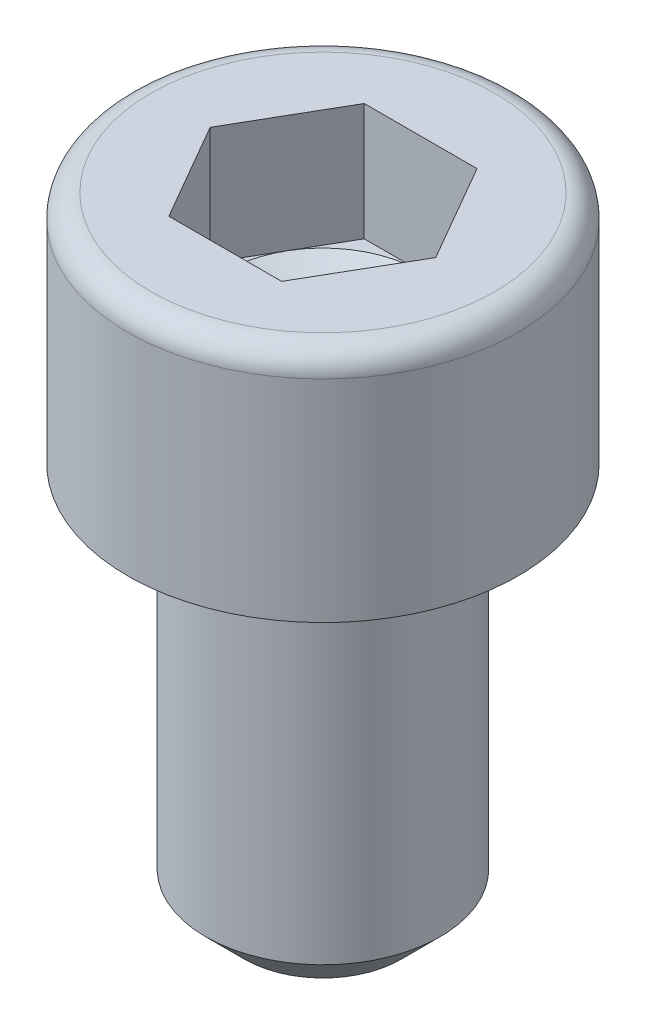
ISO-10303-21;
HEADER;
FILE_DESCRIPTION(('STEP AP214'),'2;1');
FILE_NAME('part.step','',(''),(''),'','','');
FILE_SCHEMA(('AUTOMOTIVE_DESIGN { 1 0 10303 214 1 1 1 1 }'));
ENDSEC;
DATA;
#1=APPLICATION_CONTEXT('core data for automotive mechanical design processes');
#2=APPLICATION_PROTOCOL_DEFINITION('international standard','automotive_design',2000,#1);
#3=PRODUCT_CONTEXT('',#1,'mechanical');
#4=PRODUCT('Part','Part','',(#3));
#5=PRODUCT_RELATED_PRODUCT_CATEGORY('part','',(#4));
#6=PRODUCT_DEFINITION_FORMATION('','',#4);
#7=PRODUCT_DEFINITION_CONTEXT('part definition',#1,'design');
#8=PRODUCT_DEFINITION('design','',#6,#7);
#9=PRODUCT_DEFINITION_SHAPE('','',#8);
#10=(LENGTH_UNIT() NAMED_UNIT(*) SI_UNIT(.MILLI.,.METRE.));
#11=(NAMED_UNIT(*) PLANE_ANGLE_UNIT() SI_UNIT($,.RADIAN.));
#12=(NAMED_UNIT(*) SI_UNIT($,.STERADIAN.) SOLID_ANGLE_UNIT());
#13=UNCERTAINTY_MEASURE_WITH_UNIT(LENGTH_MEASURE(1.E-05),#10,'distance_accuracy_value','');
#14=(GEOMETRIC_REPRESENTATION_CONTEXT(3) GLOBAL_UNCERTAINTY_ASSIGNED_CONTEXT((#13)) GLOBAL_UNIT_ASSIGNED_CONTEXT((#10,
#11,#12)) REPRESENTATION_CONTEXT('',''));
#15=CARTESIAN_POINT('',(0.,0.,0.));
#16=DIRECTION('',(0.,0.,1.));
#17=DIRECTION('',(1.,0.,0.));
#18=AXIS2_PLACEMENT_3D('',#15,#16,#17);
#19=CARTESIAN_POINT('',(2.5,6.,0.));
#20=DIRECTION('',(0.,-1.,0.));
#21=DIRECTION('',(1.,0.,0.));
#22=AXIS2_PLACEMENT_3D('',#19,#20,#21);
#23=PLANE('',#22);
#24=CARTESIAN_POINT('',(0.,6.,0.));
#25=DIRECTION('',(0.,1.,0.));
#26=DIRECTION('',(-1.,0.,0.));
#27=AXIS2_PLACEMENT_3D('',#24,#25,#26);
#28=CIRCLE('',#27,4.4);
#29=CARTESIAN_POINT('',(-4.4,6.,0.));
#30=VERTEX_POINT('',#29);
#31=EDGE_CURVE('E141',#30,#30,#28,.T.);
#32=ORIENTED_EDGE('',*,*,#31,.T.);
#33=EDGE_LOOP('',(#32));
#34=FACE_BOUND('',#33,.T.);
#35=DIRECTION('',(0.499999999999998,0.,0.86602540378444));
#36=VECTOR('',#35,1.);
#37=CARTESIAN_POINT('',(1.44337567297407,6.,-2.5));
#38=LINE('',#37,#36);
#39=CARTESIAN_POINT('',(1.44337567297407,6.,-2.5));
#40=VERTEX_POINT('',#39);
#41=CARTESIAN_POINT('',(2.88675134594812,6.,0.));
#42=VERTEX_POINT('',#41);
#43=EDGE_CURVE('E373',#40,#42,#38,.T.);
#44=ORIENTED_EDGE('',*,*,#43,.T.);
#45=DIRECTION('',(-0.499999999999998,0.,0.86602540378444));
#46=VECTOR('',#45,1.);
#47=CARTESIAN_POINT('',(1.44337567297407,6.,2.5));
#48=LINE('',#47,#46);
#49=CARTESIAN_POINT('',(1.44337567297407,6.,2.5));
#50=VERTEX_POINT('',#49);
#51=EDGE_CURVE('E376',#42,#50,#48,.T.);
#52=ORIENTED_EDGE('',*,*,#51,.T.);
#53=DIRECTION('',(-1.,0.,0.));
#54=VECTOR('',#53,1.);
#55=CARTESIAN_POINT('',(1.44337567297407,6.,2.5));
#56=LINE('',#55,#54);
#57=CARTESIAN_POINT('',(-1.44337567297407,6.,2.5));
#58=VERTEX_POINT('',#57);
#59=EDGE_CURVE('E379',#50,#58,#56,.T.);
#60=ORIENTED_EDGE('',*,*,#59,.T.);
#61=DIRECTION('',(-0.499999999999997,0.,-0.86602540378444));
#62=VECTOR('',#61,1.);
#63=CARTESIAN_POINT('',(-1.44337567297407,6.,2.5));
#64=LINE('',#63,#62);
#65=CARTESIAN_POINT('',(-2.88675134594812,6.,0.));
#66=VERTEX_POINT('',#65);
#67=EDGE_CURVE('E118',#58,#66,#64,.T.);
#68=ORIENTED_EDGE('',*,*,#67,.T.);
#69=DIRECTION('',(0.499999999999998,0.,-0.86602540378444));
#70=VECTOR('',#69,1.);
#71=CARTESIAN_POINT('',(-1.44337567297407,6.,-2.5));
#72=LINE('',#71,#70);
#73=CARTESIAN_POINT('',(-1.44337567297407,6.,-2.5));
#74=VERTEX_POINT('',#73);
#75=EDGE_CURVE('E370',#66,#74,#72,.T.);
#76=ORIENTED_EDGE('',*,*,#75,.T.);
#77=DIRECTION('',(1.,0.,0.));
#78=VECTOR('',#77,1.);
#79=CARTESIAN_POINT('',(1.44337567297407,6.,-2.5));
#80=LINE('',#79,#78);
#81=EDGE_CURVE('E129',#74,#40,#80,.T.);
#82=ORIENTED_EDGE('',*,*,#81,.T.);
#83=EDGE_LOOP('',(#44,#52,#60,#68,#76,#82));
#84=FACE_BOUND('',#83,.T.);
#85=ADVANCED_FACE('F35',(#34,#84),#23,.F.);
#86=CARTESIAN_POINT('',(0.,-10.,0.));
#87=DIRECTION('',(0.,1.,0.));
#88=DIRECTION('',(0.,0.,1.));
#89=AXIS2_PLACEMENT_3D('',#86,#87,#88);
#90=CYLINDRICAL_SURFACE('',#89,3.);
#91=CARTESIAN_POINT('',(0.,-9.,0.));
#92=DIRECTION('',(0.,1.,0.));
#93=DIRECTION('',(0.,0.,1.));
#94=AXIS2_PLACEMENT_3D('',#91,#92,#93);
#95=CIRCLE('',#94,3.);
#96=CARTESIAN_POINT('',(0.,-9.,3.));
#97=VERTEX_POINT('',#96);
#98=EDGE_CURVE('E43',#97,#97,#95,.T.);
#99=ORIENTED_EDGE('',*,*,#98,.T.);
#100=EDGE_LOOP('',(#99));
#101=FACE_BOUND('',#100,.T.);
#102=CARTESIAN_POINT('',(0.,0.,0.));
#103=DIRECTION('',(0.,1.,0.));
#104=DIRECTION('',(0.,0.,1.));
#105=AXIS2_PLACEMENT_3D('',#102,#103,#104);
#106=CIRCLE('',#105,3.);
#107=CARTESIAN_POINT('',(0.,0.,3.));
#108=VERTEX_POINT('',#107);
#109=EDGE_CURVE('E151',#108,#108,#106,.T.);
#110=ORIENTED_EDGE('',*,*,#109,.F.);
#111=EDGE_LOOP('',(#110));
#112=FACE_BOUND('',#111,.T.);
#113=ADVANCED_FACE('F156',(#101,#112),#90,.T.);
#114=CARTESIAN_POINT('',(0.,-10.,0.));
#115=DIRECTION('',(0.,1.,0.));
#116=DIRECTION('',(0.,0.,1.));
#117=AXIS2_PLACEMENT_3D('',#114,#115,#116);
#118=PLANE('',#117);
#119=CARTESIAN_POINT('',(0.,-10.,0.));
#120=DIRECTION('',(0.,1.,0.));
#121=DIRECTION('',(0.,0.,1.));
#122=AXIS2_PLACEMENT_3D('',#119,#120,#121);
#123=CIRCLE('',#122,2.);
#124=CARTESIAN_POINT('',(0.,-10.,2.));
#125=VERTEX_POINT('',#124);
#126=EDGE_CURVE('E11',#125,#125,#123,.F.);
#127=ORIENTED_EDGE('',*,*,#126,.T.);
#128=EDGE_LOOP('',(#127));
#129=FACE_BOUND('',#128,.T.);
#130=ADVANCED_FACE('F161',(#129),#118,.F.);
#131=CARTESIAN_POINT('',(0.,-9.,0.));
#132=DIRECTION('',(0.,1.,0.));
#133=DIRECTION('',(0.,0.,1.));
#134=AXIS2_PLACEMENT_3D('',#131,#132,#133);
#135=CONICAL_SURFACE('',#134,3.,0.785398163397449);
#136=ORIENTED_EDGE('',*,*,#126,.F.);
#137=EDGE_LOOP('',(#136));
#138=FACE_BOUND('',#137,.T.);
#139=ORIENTED_EDGE('',*,*,#98,.F.);
#140=EDGE_LOOP('',(#139));
#141=FACE_BOUND('',#140,.T.);
#142=ADVANCED_FACE('F37',(#138,#141),#135,.T.);
#143=CARTESIAN_POINT('',(0.,0.,0.));
#144=DIRECTION('',(0.,1.,0.));
#145=DIRECTION('',(-1.,0.,0.));
#146=AXIS2_PLACEMENT_3D('',#143,#144,#145);
#147=PLANE('',#146);
#148=ORIENTED_EDGE('',*,*,#109,.T.);
#149=EDGE_LOOP('',(#148));
#150=FACE_BOUND('',#149,.T.);
#151=CARTESIAN_POINT('',(0.,0.,0.));
#152=DIRECTION('',(0.,1.,0.));
#153=DIRECTION('',(-1.,0.,0.));
#154=AXIS2_PLACEMENT_3D('',#151,#152,#153);
#155=CIRCLE('',#154,5.);
#156=CARTESIAN_POINT('',(-5.,0.,0.));
#157=VERTEX_POINT('',#156);
#158=EDGE_CURVE('E148',#157,#157,#155,.T.);
#159=ORIENTED_EDGE('',*,*,#158,.F.);
#160=EDGE_LOOP('',(#159));
#161=FACE_BOUND('',#160,.T.);
#162=ADVANCED_FACE('F160',(#150,#161),#147,.F.);
#163=CARTESIAN_POINT('',(0.,6.,0.));
#164=DIRECTION('',(0.,1.,0.));
#165=DIRECTION('',(-1.,0.,0.));
#166=AXIS2_PLACEMENT_3D('',#163,#164,#165);
#167=CYLINDRICAL_SURFACE('',#166,5.);
#168=CARTESIAN_POINT('',(0.,5.4,0.));
#169=DIRECTION('',(0.,1.,0.));
#170=DIRECTION('',(-1.,0.,0.));
#171=AXIS2_PLACEMENT_3D('',#168,#169,#170);
#172=CIRCLE('',#171,5.);
#173=CARTESIAN_POINT('',(-5.,5.4,0.));
#174=VERTEX_POINT('',#173);
#175=EDGE_CURVE('E145',#174,#174,#172,.T.);
#176=ORIENTED_EDGE('',*,*,#175,.F.);
#177=EDGE_LOOP('',(#176));
#178=FACE_BOUND('',#177,.T.);
#179=ORIENTED_EDGE('',*,*,#158,.T.);
#180=EDGE_LOOP('',(#179));
#181=FACE_BOUND('',#180,.T.);
#182=ADVANCED_FACE('F167',(#178,#181),#167,.T.);
#183=CARTESIAN_POINT('',(0.,5.4,0.));
#184=DIRECTION('',(0.,1.,0.));
#185=DIRECTION('',(-1.,0.,0.));
#186=AXIS2_PLACEMENT_3D('',#183,#184,#185);
#187=TOROIDAL_SURFACE('',#186,4.4,0.6);
#188=ORIENTED_EDGE('',*,*,#31,.F.);
#189=EDGE_LOOP('',(#188));
#190=FACE_BOUND('',#189,.T.);
#191=ORIENTED_EDGE('',*,*,#175,.T.);
#192=EDGE_LOOP('',(#191));
#193=FACE_BOUND('',#192,.T.);
#194=ADVANCED_FACE('F184',(#190,#193),#187,.T.);
#195=CARTESIAN_POINT('',(-1.44337567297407,3.,-2.5));
#196=DIRECTION('',(0.86602540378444,0.,0.499999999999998));
#197=DIRECTION('',(0.499999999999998,0.,-0.86602540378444));
#198=AXIS2_PLACEMENT_3D('',#195,#196,#197);
#199=PLANE('',#198);
#200=ORIENTED_EDGE('',*,*,#75,.F.);
#201=DIRECTION('',(0.,1.,0.));
#202=VECTOR('',#201,1.);
#203=CARTESIAN_POINT('',(-2.88675134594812,3.,0.));
#204=LINE('',#203,#202);
#205=CARTESIAN_POINT('',(-2.88675134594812,3.,0.));
#206=VERTEX_POINT('',#205);
#207=EDGE_CURVE('E365',#206,#66,#204,.T.);
#208=ORIENTED_EDGE('',*,*,#207,.F.);
#209=DIRECTION('',(0.499999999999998,0.,-0.86602540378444));
#210=VECTOR('',#209,1.);
#211=CARTESIAN_POINT('',(-1.44337567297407,3.,-2.5));
#212=LINE('',#211,#210);
#213=CARTESIAN_POINT('',(-2.1650635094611,3.,-1.24999999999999));
#214=VERTEX_POINT('',#213);
#215=EDGE_CURVE('E114',#206,#214,#212,.T.);
#216=ORIENTED_EDGE('',*,*,#215,.T.);
#217=CARTESIAN_POINT('',(-1.44337567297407,3.,-2.5));
#218=VERTEX_POINT('',#217);
#219=EDGE_CURVE('E108',#214,#218,#212,.T.);
#220=ORIENTED_EDGE('',*,*,#219,.T.);
#221=DIRECTION('',(0.,1.,0.));
#222=VECTOR('',#221,1.);
#223=CARTESIAN_POINT('',(-1.44337567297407,3.,-2.5));
#224=LINE('',#223,#222);
#225=EDGE_CURVE('E110',#218,#74,#224,.T.);
#226=ORIENTED_EDGE('',*,*,#225,.T.);
#227=EDGE_LOOP('',(#200,#208,#216,#220,#226));
#228=FACE_BOUND('',#227,.T.);
#229=ADVANCED_FACE('F109',(#228),#199,.T.);
#230=CARTESIAN_POINT('',(1.44337567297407,3.,-2.5));
#231=DIRECTION('',(0.,0.,1.));
#232=DIRECTION('',(1.,0.,0.));
#233=AXIS2_PLACEMENT_3D('',#230,#231,#232);
#234=PLANE('',#233);
#235=ORIENTED_EDGE('',*,*,#81,.F.);
#236=ORIENTED_EDGE('',*,*,#225,.F.);
#237=DIRECTION('',(1.,0.,0.));
#238=VECTOR('',#237,1.);
#239=CARTESIAN_POINT('',(1.44337567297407,3.,-2.5));
#240=LINE('',#239,#238);
#241=CARTESIAN_POINT('',(0.,3.,-2.5));
#242=VERTEX_POINT('',#241);
#243=EDGE_CURVE('E50',#218,#242,#240,.T.);
#244=ORIENTED_EDGE('',*,*,#243,.T.);
#245=CARTESIAN_POINT('',(1.44337567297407,3.,-2.5));
#246=VERTEX_POINT('',#245);
#247=EDGE_CURVE('E124',#242,#246,#240,.T.);
#248=ORIENTED_EDGE('',*,*,#247,.T.);
#249=DIRECTION('',(0.,1.,0.));
#250=VECTOR('',#249,1.);
#251=CARTESIAN_POINT('',(1.44337567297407,3.,-2.5));
#252=LINE('',#251,#250);
#253=EDGE_CURVE('E131',#246,#40,#252,.T.);
#254=ORIENTED_EDGE('',*,*,#253,.T.);
#255=EDGE_LOOP('',(#235,#236,#244,#248,#254));
#256=FACE_BOUND('',#255,.T.);
#257=ADVANCED_FACE('F126',(#256),#234,.T.);
#258=CARTESIAN_POINT('',(1.44337567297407,3.,-2.5));
#259=DIRECTION('',(-0.86602540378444,0.,0.499999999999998));
#260=DIRECTION('',(0.499999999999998,0.,0.86602540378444));
#261=AXIS2_PLACEMENT_3D('',#258,#259,#260);
#262=PLANE('',#261);
#263=ORIENTED_EDGE('',*,*,#43,.F.);
#264=ORIENTED_EDGE('',*,*,#253,.F.);
#265=DIRECTION('',(0.499999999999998,0.,0.86602540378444));
#266=VECTOR('',#265,1.);
#267=CARTESIAN_POINT('',(1.44337567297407,3.,-2.5));
#268=LINE('',#267,#266);
#269=CARTESIAN_POINT('',(2.1650635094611,3.,-1.24999999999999));
#270=VERTEX_POINT('',#269);
#271=EDGE_CURVE('E398',#246,#270,#268,.T.);
#272=ORIENTED_EDGE('',*,*,#271,.T.);
#273=CARTESIAN_POINT('',(2.88675134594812,3.,0.));
#274=VERTEX_POINT('',#273);
#275=EDGE_CURVE('E123',#270,#274,#268,.T.);
#276=ORIENTED_EDGE('',*,*,#275,.T.);
#277=DIRECTION('',(0.,1.,0.));
#278=VECTOR('',#277,1.);
#279=CARTESIAN_POINT('',(2.88675134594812,3.,0.));
#280=LINE('',#279,#278);
#281=EDGE_CURVE('E136',#274,#42,#280,.T.);
#282=ORIENTED_EDGE('',*,*,#281,.T.);
#283=EDGE_LOOP('',(#263,#264,#272,#276,#282));
#284=FACE_BOUND('',#283,.T.);
#285=ADVANCED_FACE('F214',(#284),#262,.T.);
#286=CARTESIAN_POINT('',(1.44337567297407,3.,2.5));
#287=DIRECTION('',(-0.86602540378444,0.,-0.499999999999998));
#288=DIRECTION('',(-0.499999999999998,0.,0.86602540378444));
#289=AXIS2_PLACEMENT_3D('',#286,#287,#288);
#290=PLANE('',#289);
#291=ORIENTED_EDGE('',*,*,#51,.F.);
#292=ORIENTED_EDGE('',*,*,#281,.F.);
#293=DIRECTION('',(-0.499999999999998,0.,0.86602540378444));
#294=VECTOR('',#293,1.);
#295=CARTESIAN_POINT('',(1.44337567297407,3.,2.5));
#296=LINE('',#295,#294);
#297=CARTESIAN_POINT('',(2.1650635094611,3.,1.24999999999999));
#298=VERTEX_POINT('',#297);
#299=EDGE_CURVE('E396',#274,#298,#296,.T.);
#300=ORIENTED_EDGE('',*,*,#299,.T.);
#301=CARTESIAN_POINT('',(1.44337567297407,3.,2.5));
#302=VERTEX_POINT('',#301);
#303=EDGE_CURVE('E397',#298,#302,#296,.T.);
#304=ORIENTED_EDGE('',*,*,#303,.T.);
#305=DIRECTION('',(0.,1.,0.));
#306=VECTOR('',#305,1.);
#307=CARTESIAN_POINT('',(1.44337567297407,3.,2.5));
#308=LINE('',#307,#306);
#309=EDGE_CURVE('E385',#302,#50,#308,.T.);
#310=ORIENTED_EDGE('',*,*,#309,.T.);
#311=EDGE_LOOP('',(#291,#292,#300,#304,#310));
#312=FACE_BOUND('',#311,.T.);
#313=ADVANCED_FACE('F221',(#312),#290,.T.);
#314=CARTESIAN_POINT('',(1.44337567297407,3.,2.5));
#315=DIRECTION('',(0.,0.,-1.));
#316=DIRECTION('',(-1.,0.,0.));
#317=AXIS2_PLACEMENT_3D('',#314,#315,#316);
#318=PLANE('',#317);
#319=ORIENTED_EDGE('',*,*,#59,.F.);
#320=ORIENTED_EDGE('',*,*,#309,.F.);
#321=DIRECTION('',(-1.,0.,0.));
#322=VECTOR('',#321,1.);
#323=CARTESIAN_POINT('',(1.44337567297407,3.,2.5));
#324=LINE('',#323,#322);
#325=CARTESIAN_POINT('',(0.,3.,2.5));
#326=VERTEX_POINT('',#325);
#327=EDGE_CURVE('E360',#302,#326,#324,.T.);
#328=ORIENTED_EDGE('',*,*,#327,.T.);
#329=CARTESIAN_POINT('',(-1.44337567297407,3.,2.5));
#330=VERTEX_POINT('',#329);
#331=EDGE_CURVE('E356',#326,#330,#324,.T.);
#332=ORIENTED_EDGE('',*,*,#331,.T.);
#333=DIRECTION('',(0.,1.,0.));
#334=VECTOR('',#333,1.);
#335=CARTESIAN_POINT('',(-1.44337567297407,3.,2.5));
#336=LINE('',#335,#334);
#337=EDGE_CURVE('E364',#330,#58,#336,.T.);
#338=ORIENTED_EDGE('',*,*,#337,.T.);
#339=EDGE_LOOP('',(#319,#320,#328,#332,#338));
#340=FACE_BOUND('',#339,.T.);
#341=ADVANCED_FACE('F229',(#340),#318,.T.);
#342=CARTESIAN_POINT('',(-1.44337567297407,3.,2.5));
#343=DIRECTION('',(0.86602540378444,0.,-0.499999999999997));
#344=DIRECTION('',(-0.499999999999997,0.,-0.86602540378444));
#345=AXIS2_PLACEMENT_3D('',#342,#343,#344);
#346=PLANE('',#345);
#347=ORIENTED_EDGE('',*,*,#67,.F.);
#348=ORIENTED_EDGE('',*,*,#337,.F.);
#349=DIRECTION('',(-0.499999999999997,0.,-0.86602540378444));
#350=VECTOR('',#349,1.);
#351=CARTESIAN_POINT('',(-1.44337567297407,3.,2.5));
#352=LINE('',#351,#350);
#353=CARTESIAN_POINT('',(-2.1650635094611,3.,1.24999999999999));
#354=VERTEX_POINT('',#353);
#355=EDGE_CURVE('E355',#330,#354,#352,.T.);
#356=ORIENTED_EDGE('',*,*,#355,.T.);
#357=EDGE_CURVE('E358',#354,#206,#352,.T.);
#358=ORIENTED_EDGE('',*,*,#357,.T.);
#359=ORIENTED_EDGE('',*,*,#207,.T.);
#360=EDGE_LOOP('',(#347,#348,#356,#358,#359));
#361=FACE_BOUND('',#360,.T.);
#362=ADVANCED_FACE('F237',(#361),#346,.T.);
#363=CARTESIAN_POINT('',(-4.33012701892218,3.,2.5));
#364=DIRECTION('',(0.,-1.,0.));
#365=DIRECTION('',(0.,0.,-1.));
#366=AXIS2_PLACEMENT_3D('',#363,#364,#365);
#367=PLANE('',#366);
#368=ORIENTED_EDGE('',*,*,#243,.F.);
#369=ORIENTED_EDGE('',*,*,#219,.F.);
#370=CARTESIAN_POINT('',(0.,3.,0.));
#371=DIRECTION('',(0.,1.,0.));
#372=DIRECTION('',(-1.,0.,0.));
#373=AXIS2_PLACEMENT_3D('',#370,#371,#372);
#374=CIRCLE('',#373,2.5);
#375=EDGE_CURVE('E121',#242,#214,#374,.T.);
#376=ORIENTED_EDGE('',*,*,#375,.F.);
#377=EDGE_LOOP('',(#368,#369,#376));
#378=FACE_BOUND('',#377,.T.);
#379=ADVANCED_FACE('F120',(#378),#367,.F.);
#380=ORIENTED_EDGE('',*,*,#215,.F.);
#381=ORIENTED_EDGE('',*,*,#357,.F.);
#382=EDGE_CURVE('E130',#214,#354,#374,.T.);
#383=ORIENTED_EDGE('',*,*,#382,.F.);
#384=EDGE_LOOP('',(#380,#381,#383));
#385=FACE_BOUND('',#384,.T.);
#386=ADVANCED_FACE('F252',(#385),#367,.F.);
#387=ORIENTED_EDGE('',*,*,#355,.F.);
#388=ORIENTED_EDGE('',*,*,#331,.F.);
#389=EDGE_CURVE('E135',#354,#326,#374,.T.);
#390=ORIENTED_EDGE('',*,*,#389,.F.);
#391=EDGE_LOOP('',(#387,#388,#390));
#392=FACE_BOUND('',#391,.T.);
#393=ADVANCED_FACE('F260',(#392),#367,.F.);
#394=ORIENTED_EDGE('',*,*,#327,.F.);
#395=ORIENTED_EDGE('',*,*,#303,.F.);
#396=EDGE_CURVE('E142',#326,#298,#374,.T.);
#397=ORIENTED_EDGE('',*,*,#396,.F.);
#398=EDGE_LOOP('',(#394,#395,#397));
#399=FACE_BOUND('',#398,.T.);
#400=ADVANCED_FACE('F267',(#399),#367,.F.);
#401=ORIENTED_EDGE('',*,*,#299,.F.);
#402=ORIENTED_EDGE('',*,*,#275,.F.);
#403=EDGE_CURVE('E402',#298,#270,#374,.T.);
#404=ORIENTED_EDGE('',*,*,#403,.F.);
#405=EDGE_LOOP('',(#401,#402,#404));
#406=FACE_BOUND('',#405,.T.);
#407=ADVANCED_FACE('F274',(#406),#367,.F.);
#408=ORIENTED_EDGE('',*,*,#271,.F.);
#409=ORIENTED_EDGE('',*,*,#247,.F.);
#410=EDGE_CURVE('E401',#270,#242,#374,.T.);
#411=ORIENTED_EDGE('',*,*,#410,.F.);
#412=EDGE_LOOP('',(#408,#409,#411));
#413=FACE_BOUND('',#412,.T.);
#414=ADVANCED_FACE('F254',(#413),#367,.F.);
#415=CARTESIAN_POINT('',(0.,3.,0.));
#416=DIRECTION('',(0.,1.,0.));
#417=DIRECTION('',(-1.,0.,0.));
#418=AXIS2_PLACEMENT_3D('',#415,#416,#417);
#419=CONICAL_SURFACE('',#418,2.5,1.04719755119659);
#420=CARTESIAN_POINT('',(0.,1.55662432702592,0.));
#421=VERTEX_POINT('',#420);
#422=VERTEX_LOOP('',#421);
#423=FACE_BOUND('',#422,.T.);
#424=ORIENTED_EDGE('',*,*,#389,.T.);
#425=ORIENTED_EDGE('',*,*,#396,.T.);
#426=ORIENTED_EDGE('',*,*,#403,.T.);
#427=ORIENTED_EDGE('',*,*,#410,.T.);
#428=ORIENTED_EDGE('',*,*,#375,.T.);
#429=ORIENTED_EDGE('',*,*,#382,.T.);
#430=EDGE_LOOP('',(#424,#425,#426,#427,#428,#429));
#431=FACE_BOUND('',#430,.T.);
#432=ADVANCED_FACE('F182',(#423,#431),#419,.F.);
#433=CLOSED_SHELL('',(#85,#113,#130,#142,#162,#182,#194,#229,#257,#285,#313,#341,#362,#379,#386,
#393,#400,#407,#414,#432));
#434=MANIFOLD_SOLID_BREP('B2',#433);
#435=ADVANCED_BREP_SHAPE_REPRESENTATION('',(#18,#434),#14);
#436=SHAPE_DEFINITION_REPRESENTATION(#9,#435);
ENDSEC;
END-ISO-10303-21;
